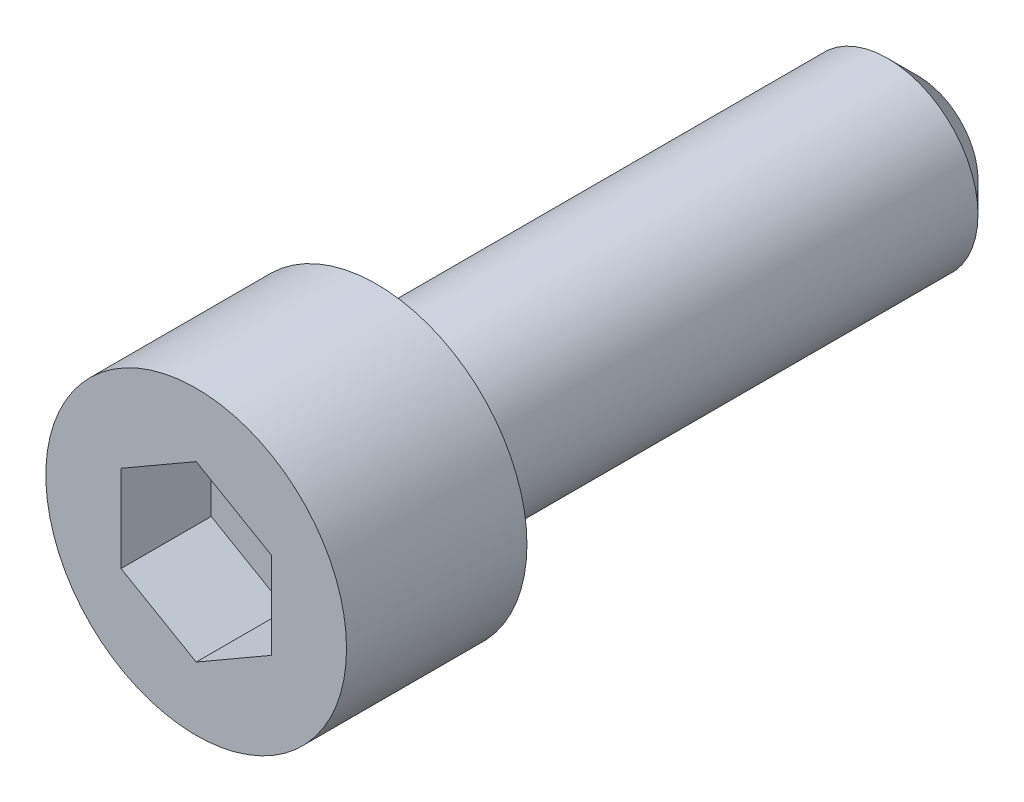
ISO-10303-21;
HEADER;
FILE_DESCRIPTION(('STEP AP214'),'2;1');
FILE_NAME('part.step','',(''),(''),'','','');
FILE_SCHEMA(('AUTOMOTIVE_DESIGN { 1 0 10303 214 1 1 1 1 }'));
ENDSEC;
DATA;
#1=APPLICATION_CONTEXT('core data for automotive mechanical design processes');
#2=APPLICATION_PROTOCOL_DEFINITION('international standard','automotive_design',2000,#1);
#3=PRODUCT_CONTEXT('',#1,'mechanical');
#4=PRODUCT('Part','Part','',(#3));
#5=PRODUCT_RELATED_PRODUCT_CATEGORY('part','',(#4));
#6=PRODUCT_DEFINITION_FORMATION('','',#4);
#7=PRODUCT_DEFINITION_CONTEXT('part definition',#1,'design');
#8=PRODUCT_DEFINITION('design','',#6,#7);
#9=PRODUCT_DEFINITION_SHAPE('','',#8);
#10=(LENGTH_UNIT() NAMED_UNIT(*) SI_UNIT(.MILLI.,.METRE.));
#11=(NAMED_UNIT(*) PLANE_ANGLE_UNIT() SI_UNIT($,.RADIAN.));
#12=(NAMED_UNIT(*) SI_UNIT($,.STERADIAN.) SOLID_ANGLE_UNIT());
#13=UNCERTAINTY_MEASURE_WITH_UNIT(LENGTH_MEASURE(1.E-05),#10,'distance_accuracy_value','');
#14=(GEOMETRIC_REPRESENTATION_CONTEXT(3) GLOBAL_UNCERTAINTY_ASSIGNED_CONTEXT((#13)) GLOBAL_UNIT_ASSIGNED_CONTEXT((#10,
#11,#12)) REPRESENTATION_CONTEXT('',''));
#15=CARTESIAN_POINT('',(0.,0.,0.));
#16=DIRECTION('',(0.,0.,1.));
#17=DIRECTION('',(1.,0.,0.));
#18=AXIS2_PLACEMENT_3D('',#15,#16,#17);
#19=CARTESIAN_POINT('',(0.,2.88675134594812,3.));
#20=DIRECTION('',(-0.5,-0.86602540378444,0.));
#21=DIRECTION('',(0.86602540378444,-0.5,0.));
#22=AXIS2_PLACEMENT_3D('',#19,#20,#21);
#23=PLANE('',#22);
#24=DIRECTION('',(0.,0.,1.));
#25=VECTOR('',#24,1.);
#26=CARTESIAN_POINT('',(2.5,1.44337567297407,3.));
#27=LINE('',#26,#25);
#28=CARTESIAN_POINT('',(2.5,1.44337567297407,3.));
#29=VERTEX_POINT('',#28);
#30=CARTESIAN_POINT('',(2.5,1.44337567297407,6.));
#31=VERTEX_POINT('',#30);
#32=EDGE_CURVE('E63',#29,#31,#27,.T.);
#33=ORIENTED_EDGE('',*,*,#32,.T.);
#34=DIRECTION('',(0.86602540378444,-0.5,0.));
#35=VECTOR('',#34,1.);
#36=CARTESIAN_POINT('',(0.,2.88675134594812,6.));
#37=LINE('',#36,#35);
#38=CARTESIAN_POINT('',(0.,2.88675134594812,6.));
#39=VERTEX_POINT('',#38);
#40=EDGE_CURVE('E29',#39,#31,#37,.T.);
#41=ORIENTED_EDGE('',*,*,#40,.F.);
#42=DIRECTION('',(0.,0.,1.));
#43=VECTOR('',#42,1.);
#44=CARTESIAN_POINT('',(0.,2.88675134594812,3.));
#45=LINE('',#44,#43);
#46=CARTESIAN_POINT('',(0.,2.88675134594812,3.));
#47=VERTEX_POINT('',#46);
#48=EDGE_CURVE('E33',#47,#39,#45,.T.);
#49=ORIENTED_EDGE('',*,*,#48,.F.);
#50=DIRECTION('',(0.86602540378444,-0.5,0.));
#51=VECTOR('',#50,1.);
#52=CARTESIAN_POINT('',(0.,2.88675134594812,3.));
#53=LINE('',#52,#51);
#54=EDGE_CURVE('E65',#47,#29,#53,.T.);
#55=ORIENTED_EDGE('',*,*,#54,.T.);
#56=EDGE_LOOP('',(#33,#41,#49,#55));
#57=FACE_BOUND('',#56,.T.);
#58=ADVANCED_FACE('F14',(#57),#23,.T.);
#59=CARTESIAN_POINT('',(2.5,-1.44337567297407,3.));
#60=DIRECTION('',(1.,0.,0.));
#61=DIRECTION('',(0.,1.,0.));
#62=AXIS2_PLACEMENT_3D('',#59,#60,#61);
#63=PLANE('',#62);
#64=DIRECTION('',(0.,0.,1.));
#65=VECTOR('',#64,1.);
#66=CARTESIAN_POINT('',(2.5,-1.44337567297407,3.));
#67=LINE('',#66,#65);
#68=CARTESIAN_POINT('',(2.5,-1.44337567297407,3.));
#69=VERTEX_POINT('',#68);
#70=CARTESIAN_POINT('',(2.5,-1.44337567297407,6.));
#71=VERTEX_POINT('',#70);
#72=EDGE_CURVE('E70',#69,#71,#67,.T.);
#73=ORIENTED_EDGE('',*,*,#72,.T.);
#74=DIRECTION('',(0.,1.,0.));
#75=VECTOR('',#74,1.);
#76=CARTESIAN_POINT('',(2.5,-1.44337567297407,6.));
#77=LINE('',#76,#75);
#78=EDGE_CURVE('E73',#71,#31,#77,.T.);
#79=ORIENTED_EDGE('',*,*,#78,.T.);
#80=ORIENTED_EDGE('',*,*,#32,.F.);
#81=DIRECTION('',(0.,1.,0.));
#82=VECTOR('',#81,1.);
#83=CARTESIAN_POINT('',(2.5,-1.44337567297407,3.));
#84=LINE('',#83,#82);
#85=EDGE_CURVE('E100',#69,#29,#84,.T.);
#86=ORIENTED_EDGE('',*,*,#85,.F.);
#87=EDGE_LOOP('',(#73,#79,#80,#86));
#88=FACE_BOUND('',#87,.T.);
#89=ADVANCED_FACE('F74',(#88),#63,.F.);
#90=CARTESIAN_POINT('',(0.,-2.88675134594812,3.));
#91=DIRECTION('',(0.5,-0.86602540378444,0.));
#92=DIRECTION('',(0.86602540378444,0.5,0.));
#93=AXIS2_PLACEMENT_3D('',#90,#91,#92);
#94=PLANE('',#93);
#95=DIRECTION('',(0.,0.,1.));
#96=VECTOR('',#95,1.);
#97=CARTESIAN_POINT('',(0.,-2.88675134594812,3.));
#98=LINE('',#97,#96);
#99=CARTESIAN_POINT('',(0.,-2.88675134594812,3.));
#100=VERTEX_POINT('',#99);
#101=CARTESIAN_POINT('',(0.,-2.88675134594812,6.));
#102=VERTEX_POINT('',#101);
#103=EDGE_CURVE('E108',#100,#102,#98,.T.);
#104=ORIENTED_EDGE('',*,*,#103,.T.);
#105=DIRECTION('',(0.86602540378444,0.5,0.));
#106=VECTOR('',#105,1.);
#107=CARTESIAN_POINT('',(0.,-2.88675134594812,6.));
#108=LINE('',#107,#106);
#109=EDGE_CURVE('E78',#102,#71,#108,.T.);
#110=ORIENTED_EDGE('',*,*,#109,.T.);
#111=ORIENTED_EDGE('',*,*,#72,.F.);
#112=DIRECTION('',(0.86602540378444,0.5,0.));
#113=VECTOR('',#112,1.);
#114=CARTESIAN_POINT('',(0.,-2.88675134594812,3.));
#115=LINE('',#114,#113);
#116=EDGE_CURVE('E97',#100,#69,#115,.T.);
#117=ORIENTED_EDGE('',*,*,#116,.F.);
#118=EDGE_LOOP('',(#104,#110,#111,#117));
#119=FACE_BOUND('',#118,.T.);
#120=ADVANCED_FACE('F139',(#119),#94,.F.);
#121=CARTESIAN_POINT('',(0.,-2.88675134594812,3.));
#122=DIRECTION('',(0.5,0.86602540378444,0.));
#123=DIRECTION('',(-0.86602540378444,0.5,0.));
#124=AXIS2_PLACEMENT_3D('',#121,#122,#123);
#125=PLANE('',#124);
#126=DIRECTION('',(0.,0.,1.));
#127=VECTOR('',#126,1.);
#128=CARTESIAN_POINT('',(-2.5,-1.44337567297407,3.));
#129=LINE('',#128,#127);
#130=CARTESIAN_POINT('',(-2.5,-1.44337567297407,3.));
#131=VERTEX_POINT('',#130);
#132=CARTESIAN_POINT('',(-2.5,-1.44337567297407,6.));
#133=VERTEX_POINT('',#132);
#134=EDGE_CURVE('E106',#131,#133,#129,.T.);
#135=ORIENTED_EDGE('',*,*,#134,.T.);
#136=DIRECTION('',(-0.86602540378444,0.5,0.));
#137=VECTOR('',#136,1.);
#138=CARTESIAN_POINT('',(0.,-2.88675134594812,6.));
#139=LINE('',#138,#137);
#140=EDGE_CURVE('E188',#102,#133,#139,.T.);
#141=ORIENTED_EDGE('',*,*,#140,.F.);
#142=ORIENTED_EDGE('',*,*,#103,.F.);
#143=DIRECTION('',(-0.86602540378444,0.5,0.));
#144=VECTOR('',#143,1.);
#145=CARTESIAN_POINT('',(0.,-2.88675134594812,3.));
#146=LINE('',#145,#144);
#147=EDGE_CURVE('E94',#100,#131,#146,.T.);
#148=ORIENTED_EDGE('',*,*,#147,.T.);
#149=EDGE_LOOP('',(#135,#141,#142,#148));
#150=FACE_BOUND('',#149,.T.);
#151=ADVANCED_FACE('F151',(#150),#125,.T.);
#152=CARTESIAN_POINT('',(-2.5,1.44337567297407,3.));
#153=DIRECTION('',(-1.,0.,0.));
#154=DIRECTION('',(0.,-1.,0.));
#155=AXIS2_PLACEMENT_3D('',#152,#153,#154);
#156=PLANE('',#155);
#157=DIRECTION('',(0.,0.,1.));
#158=VECTOR('',#157,1.);
#159=CARTESIAN_POINT('',(-2.5,1.44337567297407,3.));
#160=LINE('',#159,#158);
#161=CARTESIAN_POINT('',(-2.5,1.44337567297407,3.));
#162=VERTEX_POINT('',#161);
#163=CARTESIAN_POINT('',(-2.5,1.44337567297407,6.));
#164=VERTEX_POINT('',#163);
#165=EDGE_CURVE('E104',#162,#164,#160,.T.);
#166=ORIENTED_EDGE('',*,*,#165,.T.);
#167=DIRECTION('',(0.,-1.,0.));
#168=VECTOR('',#167,1.);
#169=CARTESIAN_POINT('',(-2.5,1.44337567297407,6.));
#170=LINE('',#169,#168);
#171=EDGE_CURVE('E189',#164,#133,#170,.T.);
#172=ORIENTED_EDGE('',*,*,#171,.T.);
#173=ORIENTED_EDGE('',*,*,#134,.F.);
#174=DIRECTION('',(0.,-1.,0.));
#175=VECTOR('',#174,1.);
#176=CARTESIAN_POINT('',(-2.5,1.44337567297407,3.));
#177=LINE('',#176,#175);
#178=EDGE_CURVE('E91',#162,#131,#177,.T.);
#179=ORIENTED_EDGE('',*,*,#178,.F.);
#180=EDGE_LOOP('',(#166,#172,#173,#179));
#181=FACE_BOUND('',#180,.T.);
#182=ADVANCED_FACE('F147',(#181),#156,.F.);
#183=CARTESIAN_POINT('',(0.,2.88675134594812,3.));
#184=DIRECTION('',(-0.5,0.86602540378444,0.));
#185=DIRECTION('',(-0.86602540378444,-0.5,0.));
#186=AXIS2_PLACEMENT_3D('',#183,#184,#185);
#187=PLANE('',#186);
#188=DIRECTION('',(-0.86602540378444,-0.5,0.));
#189=VECTOR('',#188,1.);
#190=CARTESIAN_POINT('',(0.,2.88675134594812,3.));
#191=LINE('',#190,#189);
#192=EDGE_CURVE('E88',#47,#162,#191,.T.);
#193=ORIENTED_EDGE('',*,*,#192,.F.);
#194=ORIENTED_EDGE('',*,*,#48,.T.);
#195=DIRECTION('',(-0.86602540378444,-0.5,0.));
#196=VECTOR('',#195,1.);
#197=CARTESIAN_POINT('',(0.,2.88675134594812,6.));
#198=LINE('',#197,#196);
#199=EDGE_CURVE('E84',#39,#164,#198,.T.);
#200=ORIENTED_EDGE('',*,*,#199,.T.);
#201=ORIENTED_EDGE('',*,*,#165,.F.);
#202=EDGE_LOOP('',(#193,#194,#200,#201));
#203=FACE_BOUND('',#202,.T.);
#204=ADVANCED_FACE('F144',(#203),#187,.F.);
#205=CARTESIAN_POINT('',(2.5,1.44337567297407,3.));
#206=DIRECTION('',(0.,0.,1.));
#207=DIRECTION('',(1.,0.,0.));
#208=AXIS2_PLACEMENT_3D('',#205,#206,#207);
#209=PLANE('',#208);
#210=ORIENTED_EDGE('',*,*,#54,.F.);
#211=ORIENTED_EDGE('',*,*,#192,.T.);
#212=ORIENTED_EDGE('',*,*,#178,.T.);
#213=ORIENTED_EDGE('',*,*,#147,.F.);
#214=ORIENTED_EDGE('',*,*,#116,.T.);
#215=ORIENTED_EDGE('',*,*,#85,.T.);
#216=EDGE_LOOP('',(#210,#211,#212,#213,#214,#215));
#217=FACE_BOUND('',#216,.T.);
#218=ADVANCED_FACE('F143',(#217),#209,.T.);
#219=CARTESIAN_POINT('',(0.,0.,6.));
#220=DIRECTION('',(0.,0.,1.));
#221=DIRECTION('',(1.,0.,0.));
#222=AXIS2_PLACEMENT_3D('',#219,#220,#221);
#223=PLANE('',#222);
#224=CARTESIAN_POINT('',(0.,0.,6.));
#225=DIRECTION('',(0.,0.,1.));
#226=DIRECTION('',(1.,0.,0.));
#227=AXIS2_PLACEMENT_3D('',#224,#225,#226);
#228=CIRCLE('',#227,5.);
#229=CARTESIAN_POINT('',(5.,0.,6.));
#230=VERTEX_POINT('',#229);
#231=EDGE_CURVE('E116',#230,#230,#228,.T.);
#232=ORIENTED_EDGE('',*,*,#231,.T.);
#233=EDGE_LOOP('',(#232));
#234=FACE_BOUND('',#233,.T.);
#235=ORIENTED_EDGE('',*,*,#199,.F.);
#236=ORIENTED_EDGE('',*,*,#40,.T.);
#237=ORIENTED_EDGE('',*,*,#78,.F.);
#238=ORIENTED_EDGE('',*,*,#109,.F.);
#239=ORIENTED_EDGE('',*,*,#140,.T.);
#240=ORIENTED_EDGE('',*,*,#171,.F.);
#241=EDGE_LOOP('',(#235,#236,#237,#238,#239,#240));
#242=FACE_BOUND('',#241,.T.);
#243=ADVANCED_FACE('F81',(#234,#242),#223,.T.);
#244=CARTESIAN_POINT('',(0.,0.,5.));
#245=DIRECTION('',(0.,0.,1.));
#246=DIRECTION('',(1.,0.,0.));
#247=AXIS2_PLACEMENT_3D('',#244,#245,#246);
#248=CYLINDRICAL_SURFACE('',#247,5.);
#249=CARTESIAN_POINT('',(0.,0.,0.));
#250=DIRECTION('',(0.,0.,1.));
#251=DIRECTION('',(1.,0.,0.));
#252=AXIS2_PLACEMENT_3D('',#249,#250,#251);
#253=CIRCLE('',#252,5.);
#254=CARTESIAN_POINT('',(5.,0.,0.));
#255=VERTEX_POINT('',#254);
#256=EDGE_CURVE('E113',#255,#255,#253,.T.);
#257=ORIENTED_EDGE('',*,*,#256,.T.);
#258=EDGE_LOOP('',(#257));
#259=FACE_BOUND('',#258,.T.);
#260=ORIENTED_EDGE('',*,*,#231,.F.);
#261=EDGE_LOOP('',(#260));
#262=FACE_BOUND('',#261,.T.);
#263=ADVANCED_FACE('F165',(#259,#262),#248,.T.);
#264=CARTESIAN_POINT('',(5.,0.,0.));
#265=DIRECTION('',(0.,0.,-1.));
#266=DIRECTION('',(-1.,0.,0.));
#267=AXIS2_PLACEMENT_3D('',#264,#265,#266);
#268=PLANE('',#267);
#269=CARTESIAN_POINT('',(0.,0.,0.));
#270=DIRECTION('',(0.,0.,1.));
#271=DIRECTION('',(1.,0.,0.));
#272=AXIS2_PLACEMENT_3D('',#269,#270,#271);
#273=CIRCLE('',#272,3.);
#274=CARTESIAN_POINT('',(3.,0.,0.));
#275=VERTEX_POINT('',#274);
#276=EDGE_CURVE('E69',#275,#275,#273,.T.);
#277=ORIENTED_EDGE('',*,*,#276,.T.);
#278=EDGE_LOOP('',(#277));
#279=FACE_BOUND('',#278,.T.);
#280=ORIENTED_EDGE('',*,*,#256,.F.);
#281=EDGE_LOOP('',(#280));
#282=FACE_BOUND('',#281,.T.);
#283=ADVANCED_FACE('F161',(#279,#282),#268,.T.);
#284=CARTESIAN_POINT('',(0.,0.,5.));
#285=DIRECTION('',(0.,0.,1.));
#286=DIRECTION('',(1.,0.,0.));
#287=AXIS2_PLACEMENT_3D('',#284,#285,#286);
#288=CYLINDRICAL_SURFACE('',#287,3.);
#289=CARTESIAN_POINT('',(0.,0.,-17.));
#290=DIRECTION('',(0.,0.,-1.));
#291=DIRECTION('',(-1.,0.,0.));
#292=AXIS2_PLACEMENT_3D('',#289,#290,#291);
#293=CIRCLE('',#292,3.);
#294=CARTESIAN_POINT('',(-3.,0.,-17.));
#295=VERTEX_POINT('',#294);
#296=EDGE_CURVE('E9',#295,#295,#293,.F.);
#297=ORIENTED_EDGE('',*,*,#296,.T.);
#298=EDGE_LOOP('',(#297));
#299=FACE_BOUND('',#298,.T.);
#300=ORIENTED_EDGE('',*,*,#276,.F.);
#301=EDGE_LOOP('',(#300));
#302=FACE_BOUND('',#301,.T.);
#303=ADVANCED_FACE('F130',(#299,#302),#288,.T.);
#304=CARTESIAN_POINT('',(0.,0.,-18.));
#305=DIRECTION('',(0.,0.,-1.));
#306=DIRECTION('',(-1.,0.,0.));
#307=AXIS2_PLACEMENT_3D('',#304,#305,#306);
#308=PLANE('',#307);
#309=CARTESIAN_POINT('',(0.,0.,-18.));
#310=DIRECTION('',(0.,0.,-1.));
#311=DIRECTION('',(-1.,0.,0.));
#312=AXIS2_PLACEMENT_3D('',#309,#310,#311);
#313=CIRCLE('',#312,2.);
#314=CARTESIAN_POINT('',(-2.,0.,-18.));
#315=VERTEX_POINT('',#314);
#316=EDGE_CURVE('E22',#315,#315,#313,.T.);
#317=ORIENTED_EDGE('',*,*,#316,.T.);
#318=EDGE_LOOP('',(#317));
#319=FACE_BOUND('',#318,.T.);
#320=ADVANCED_FACE('F121',(#319),#308,.T.);
#321=CARTESIAN_POINT('',(0.,0.,-18.));
#322=DIRECTION('',(0.,0.,1.));
#323=DIRECTION('',(1.,0.,0.));
#324=AXIS2_PLACEMENT_3D('',#321,#322,#323);
#325=CONICAL_SURFACE('',#324,2.,0.785398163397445);
#326=ORIENTED_EDGE('',*,*,#296,.F.);
#327=EDGE_LOOP('',(#326));
#328=FACE_BOUND('',#327,.T.);
#329=ORIENTED_EDGE('',*,*,#316,.F.);
#330=EDGE_LOOP('',(#329));
#331=FACE_BOUND('',#330,.T.);
#332=ADVANCED_FACE('F16',(#328,#331),#325,.T.);
#333=CLOSED_SHELL('',(#58,#89,#120,#151,#182,#204,#218,#243,#263,#283,#303,#320,#332));
#334=MANIFOLD_SOLID_BREP('B1',#333);
#335=ADVANCED_BREP_SHAPE_REPRESENTATION('',(#18,#334),#14);
#336=SHAPE_DEFINITION_REPRESENTATION(#9,#335);
ENDSEC;
END-ISO-10303-21;
